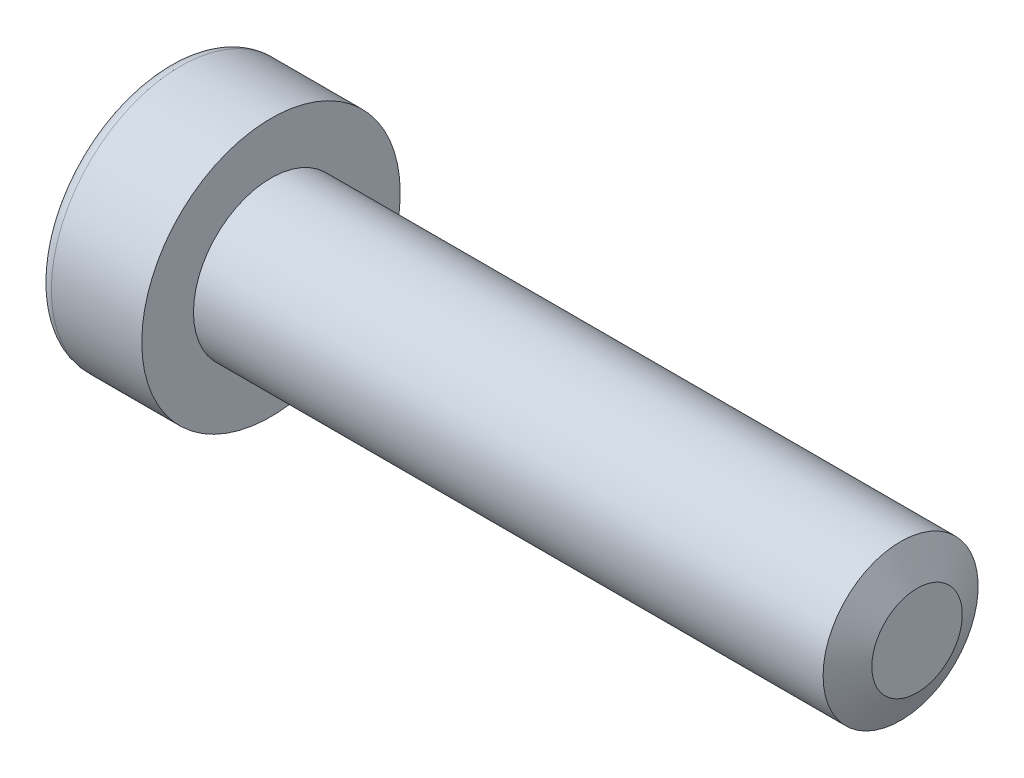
from build123d import *

# Parameters (mm, degrees)
VERRUNDUNG1_R                   = 0.5
SCHNITT_LINEAR_AUSTRAGEN1_DEPTH = 3
FASE1_SIZE                      = 1.25
FASE1_SIZE2                     = 0.636906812


with BuildPart() as part:
    # Skizze1 → Rotation1 (revolve)
    with BuildSketch(Plane.XY, mode=Mode.PRIVATE) as rotation1_sk:
        Polygon((-29, 0), (-29, 5), (-25, 5), (-25, 3), (0, 3), (0, 0), align=None)
    revolve(rotation1_sk.sketch.rotate(Axis((-65.011808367, 0, 0), (1, 0, 0)), 90), axis=Axis((-65.011808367, 0, 0), (1, 0, 0)))

    # Verrundung1
    verrundung1_edges = [part.edges().sort_by_distance(p)[0] for p in [
        (-29, 0, -5),
    ]]
    fillet(verrundung1_edges, radius=VERRUNDUNG1_R)

    # Skizze2 → Schnitt-Linear austragen1 (cut)
    with BuildSketch(Plane.ZY.offset(29)):
        Polygon((2, 1.154700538), (0, 2.309401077), (-2, 1.154700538), (-2, -1.154700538), (0, -2.309401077), (2, -1.154700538), align=None)
    extrude(amount=-SCHNITT_LINEAR_AUSTRAGEN1_DEPTH, mode=Mode.SUBTRACT)

    # Fase1
    fase1_edges = [part.edges().sort_by_distance(p)[0] for p in [
        (0, 0, -3),
    ]]
    fase1_side = [part.faces().sort_by_distance(p)[0] for p in [
        (0, 0, 0),
    ]]
    chamfer(fase1_edges, length=FASE1_SIZE, length2=FASE1_SIZE2, reference=fase1_side[0])


solid = part.part
